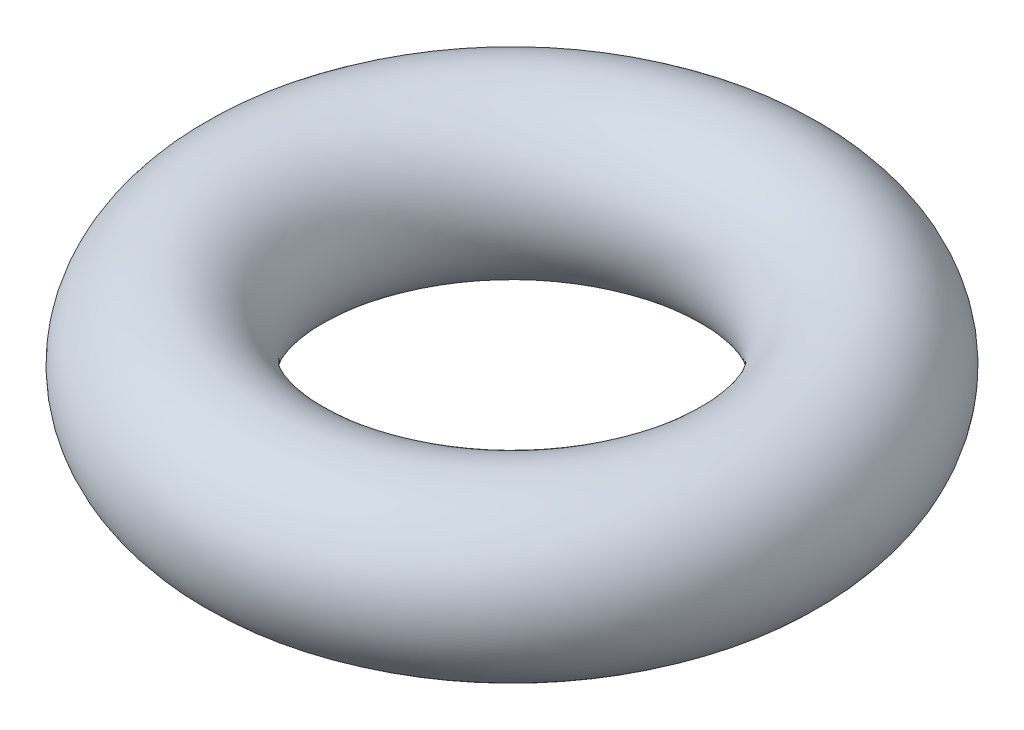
ISO-10303-21;
HEADER;
FILE_DESCRIPTION(('STEP AP214'),'2;1');
FILE_NAME('part.step','',(''),(''),'','','');
FILE_SCHEMA(('AUTOMOTIVE_DESIGN { 1 0 10303 214 1 1 1 1 }'));
ENDSEC;
DATA;
#1=APPLICATION_CONTEXT('core data for automotive mechanical design processes');
#2=APPLICATION_PROTOCOL_DEFINITION('international standard','automotive_design',2000,#1);
#3=PRODUCT_CONTEXT('',#1,'mechanical');
#4=PRODUCT('Part','Part','',(#3));
#5=PRODUCT_RELATED_PRODUCT_CATEGORY('part','',(#4));
#6=PRODUCT_DEFINITION_FORMATION('','',#4);
#7=PRODUCT_DEFINITION_CONTEXT('part definition',#1,'design');
#8=PRODUCT_DEFINITION('design','',#6,#7);
#9=PRODUCT_DEFINITION_SHAPE('','',#8);
#10=(LENGTH_UNIT() NAMED_UNIT(*) SI_UNIT(.MILLI.,.METRE.));
#11=(NAMED_UNIT(*) PLANE_ANGLE_UNIT() SI_UNIT($,.RADIAN.));
#12=(NAMED_UNIT(*) SI_UNIT($,.STERADIAN.) SOLID_ANGLE_UNIT());
#13=UNCERTAINTY_MEASURE_WITH_UNIT(LENGTH_MEASURE(1.E-05),#10,'distance_accuracy_value','');
#14=(GEOMETRIC_REPRESENTATION_CONTEXT(3) GLOBAL_UNCERTAINTY_ASSIGNED_CONTEXT((#13)) GLOBAL_UNIT_ASSIGNED_CONTEXT((#10,
#11,#12)) REPRESENTATION_CONTEXT('',''));
#15=CARTESIAN_POINT('',(0.,0.,0.));
#16=DIRECTION('',(0.,0.,1.));
#17=DIRECTION('',(1.,0.,0.));
#18=AXIS2_PLACEMENT_3D('',#15,#16,#17);
#19=CARTESIAN_POINT('',(0.,0.,0.));
#20=DIRECTION('',(0.,-1.,0.));
#21=DIRECTION('',(0.,0.,-1.));
#22=AXIS2_PLACEMENT_3D('',#19,#20,#21);
#23=TOROIDAL_SURFACE('',#22,1.5,0.499999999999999);
#24=CARTESIAN_POINT('',(0.,0.,-2.));
#25=VERTEX_POINT('',#24);
#26=VERTEX_LOOP('',#25);
#27=FACE_BOUND('',#26,.T.);
#28=ADVANCED_FACE('F32',(#27),#23,.T.);
#29=CLOSED_SHELL('',(#28));
#30=MANIFOLD_SOLID_BREP('B2',#29);
#31=ADVANCED_BREP_SHAPE_REPRESENTATION('',(#18,#30),#14);
#32=SHAPE_DEFINITION_REPRESENTATION(#9,#31);
ENDSEC;
END-ISO-10303-21;
